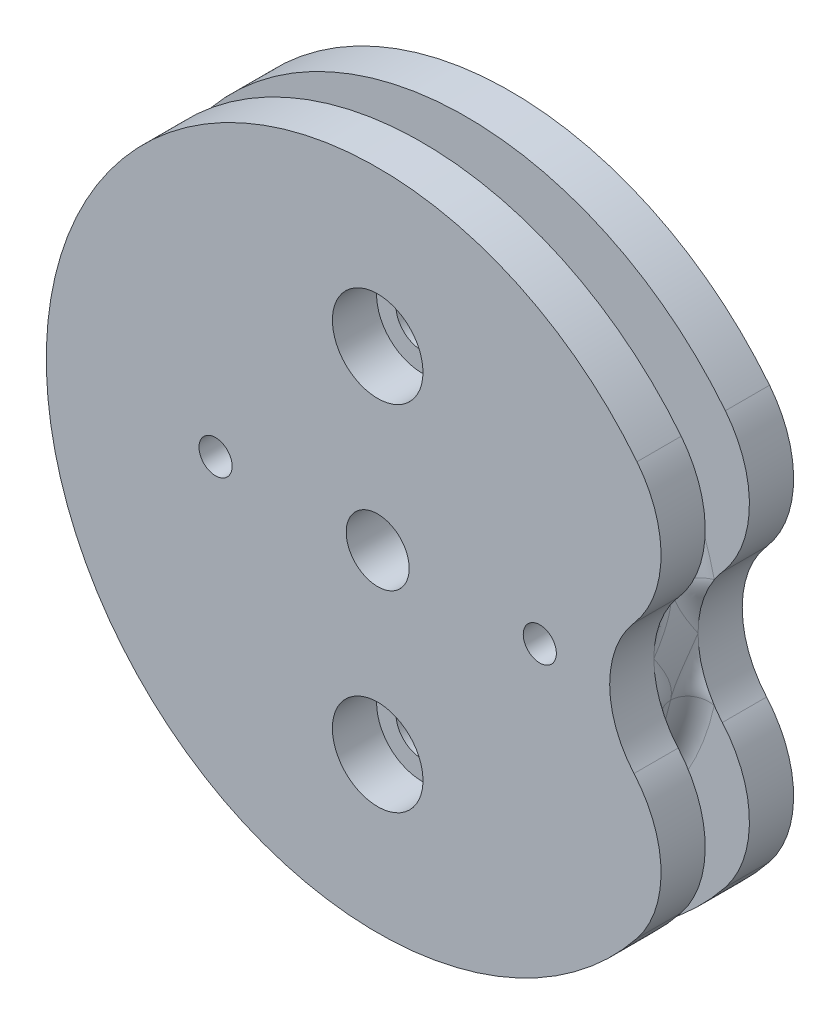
ISO-10303-21;
HEADER;
FILE_DESCRIPTION(('STEP AP214'),'2;1');
FILE_NAME('part.step','',(''),(''),'','','');
FILE_SCHEMA(('AUTOMOTIVE_DESIGN { 1 0 10303 214 1 1 1 1 }'));
ENDSEC;
DATA;
#1=APPLICATION_CONTEXT('core data for automotive mechanical design processes');
#2=APPLICATION_PROTOCOL_DEFINITION('international standard','automotive_design',2000,#1);
#3=PRODUCT_CONTEXT('',#1,'mechanical');
#4=PRODUCT('Part','Part','',(#3));
#5=PRODUCT_RELATED_PRODUCT_CATEGORY('part','',(#4));
#6=PRODUCT_DEFINITION_FORMATION('','',#4);
#7=PRODUCT_DEFINITION_CONTEXT('part definition',#1,'design');
#8=PRODUCT_DEFINITION('design','',#6,#7);
#9=PRODUCT_DEFINITION_SHAPE('','',#8);
#10=(LENGTH_UNIT() NAMED_UNIT(*) SI_UNIT(.MILLI.,.METRE.));
#11=(NAMED_UNIT(*) PLANE_ANGLE_UNIT() SI_UNIT($,.RADIAN.));
#12=(NAMED_UNIT(*) SI_UNIT($,.STERADIAN.) SOLID_ANGLE_UNIT());
#13=UNCERTAINTY_MEASURE_WITH_UNIT(LENGTH_MEASURE(1.E-05),#10,'distance_accuracy_value','');
#14=(GEOMETRIC_REPRESENTATION_CONTEXT(3) GLOBAL_UNCERTAINTY_ASSIGNED_CONTEXT((#13)) GLOBAL_UNIT_ASSIGNED_CONTEXT((#10,
#11,#12)) REPRESENTATION_CONTEXT('',''));
#15=CARTESIAN_POINT('',(0.,0.,0.));
#16=DIRECTION('',(0.,0.,1.));
#17=DIRECTION('',(1.,0.,0.));
#18=AXIS2_PLACEMENT_3D('',#15,#16,#17);
#19=CARTESIAN_POINT('',(0.,0.,3.));
#20=DIRECTION('',(0.,0.,-1.));
#21=DIRECTION('',(-1.,0.,0.));
#22=AXIS2_PLACEMENT_3D('',#19,#20,#21);
#23=CYLINDRICAL_SURFACE('',#22,15.);
#24=CARTESIAN_POINT('',(0.,0.,-1.));
#25=DIRECTION('',(0.,0.,1.));
#26=DIRECTION('',(1.,0.,0.));
#27=AXIS2_PLACEMENT_3D('',#24,#25,#26);
#28=CIRCLE('',#27,15.);
#29=CARTESIAN_POINT('',(11.7375,9.33975876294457,-1.));
#30=VERTEX_POINT('',#29);
#31=CARTESIAN_POINT('',(11.7375,-9.33975876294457,-1.));
#32=VERTEX_POINT('',#31);
#33=EDGE_CURVE('E235',#30,#32,#28,.T.);
#34=ORIENTED_EDGE('',*,*,#33,.F.);
#35=DIRECTION('',(0.,0.,-1.));
#36=VECTOR('',#35,1.);
#37=CARTESIAN_POINT('',(11.7375,9.33975876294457,3.));
#38=LINE('',#37,#36);
#39=CARTESIAN_POINT('',(11.7375,9.33975876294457,-3.));
#40=VERTEX_POINT('',#39);
#41=EDGE_CURVE('E447',#30,#40,#38,.T.);
#42=ORIENTED_EDGE('',*,*,#41,.T.);
#43=CARTESIAN_POINT('',(0.,0.,-3.));
#44=DIRECTION('',(0.,0.,1.));
#45=DIRECTION('',(1.,0.,0.));
#46=AXIS2_PLACEMENT_3D('',#43,#44,#45);
#47=CIRCLE('',#46,15.);
#48=CARTESIAN_POINT('',(11.7375,-9.33975876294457,-3.));
#49=VERTEX_POINT('',#48);
#50=EDGE_CURVE('E212',#40,#49,#47,.T.);
#51=ORIENTED_EDGE('',*,*,#50,.T.);
#52=DIRECTION('',(0.,0.,-1.));
#53=VECTOR('',#52,1.);
#54=CARTESIAN_POINT('',(11.7375,-9.33975876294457,3.));
#55=LINE('',#54,#53);
#56=EDGE_CURVE('E444',#49,#32,#55,.F.);
#57=ORIENTED_EDGE('',*,*,#56,.T.);
#58=EDGE_LOOP('',(#34,#42,#51,#57));
#59=FACE_BOUND('',#58,.T.);
#60=ADVANCED_FACE('F36',(#59),#23,.T.);
#61=CARTESIAN_POINT('',(0.,0.,3.));
#62=DIRECTION('',(0.,0.,-1.));
#63=DIRECTION('',(-1.,0.,0.));
#64=AXIS2_PLACEMENT_3D('',#61,#62,#63);
#65=CYLINDRICAL_SURFACE('',#64,4.175);
#66=CARTESIAN_POINT('',(0.,0.,-3.));
#67=DIRECTION('',(0.,0.,1.));
#68=DIRECTION('',(1.,0.,0.));
#69=AXIS2_PLACEMENT_3D('',#66,#67,#68);
#70=CIRCLE('',#69,4.175);
#71=CARTESIAN_POINT('',(4.175,0.,-3.));
#72=VERTEX_POINT('',#71);
#73=EDGE_CURVE('E216',#72,#72,#70,.T.);
#74=ORIENTED_EDGE('',*,*,#73,.F.);
#75=EDGE_LOOP('',(#74));
#76=FACE_BOUND('',#75,.T.);
#77=CARTESIAN_POINT('',(0.,0.,-0.150000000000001));
#78=DIRECTION('',(0.,0.,1.));
#79=DIRECTION('',(1.,0.,0.));
#80=AXIS2_PLACEMENT_3D('',#77,#78,#79);
#81=CIRCLE('',#80,4.175);
#82=CARTESIAN_POINT('',(4.175,0.,-0.150000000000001));
#83=VERTEX_POINT('',#82);
#84=EDGE_CURVE('E240',#83,#83,#81,.F.);
#85=ORIENTED_EDGE('',*,*,#84,.F.);
#86=EDGE_LOOP('',(#85));
#87=FACE_BOUND('',#86,.T.);
#88=ADVANCED_FACE('F403',(#76,#87),#65,.F.);
#89=CARTESIAN_POINT('',(0.,0.,3.));
#90=DIRECTION('',(0.,0.,1.));
#91=DIRECTION('',(1.,0.,0.));
#92=AXIS2_PLACEMENT_3D('',#89,#90,#91);
#93=PLANE('',#92);
#94=CARTESIAN_POINT('',(-7.3375,0.,3.));
#95=DIRECTION('',(0.,0.,-1.));
#96=DIRECTION('',(1.,0.,0.));
#97=AXIS2_PLACEMENT_3D('',#94,#95,#96);
#98=CIRCLE('',#97,0.749999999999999);
#99=CARTESIAN_POINT('',(-6.5875,0.,3.));
#100=VERTEX_POINT('',#99);
#101=EDGE_CURVE('E183',#100,#100,#98,.T.);
#102=ORIENTED_EDGE('',*,*,#101,.T.);
#103=EDGE_LOOP('',(#102));
#104=FACE_BOUND('',#103,.T.);
#105=CARTESIAN_POINT('',(7.3375,0.,3.));
#106=DIRECTION('',(0.,0.,-1.));
#107=DIRECTION('',(-1.,0.,0.));
#108=AXIS2_PLACEMENT_3D('',#105,#106,#107);
#109=CIRCLE('',#108,0.749999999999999);
#110=CARTESIAN_POINT('',(6.5875,0.,3.));
#111=VERTEX_POINT('',#110);
#112=EDGE_CURVE('E182',#111,#111,#109,.T.);
#113=ORIENTED_EDGE('',*,*,#112,.T.);
#114=EDGE_LOOP('',(#113));
#115=FACE_BOUND('',#114,.T.);
#116=CARTESIAN_POINT('',(15.,0.,3.));
#117=DIRECTION('',(0.,0.,1.));
#118=DIRECTION('',(1.,0.,0.));
#119=AXIS2_PLACEMENT_3D('',#116,#117,#118);
#120=CIRCLE('',#119,4.5);
#121=CARTESIAN_POINT('',(11.6013157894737,2.94939750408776,3.));
#122=VERTEX_POINT('',#121);
#123=CARTESIAN_POINT('',(11.6013157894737,-2.94939750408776,3.));
#124=VERTEX_POINT('',#123);
#125=EDGE_CURVE('E172',#122,#124,#120,.T.);
#126=ORIENTED_EDGE('',*,*,#125,.F.);
#127=CARTESIAN_POINT('',(7.825,6.22650584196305,3.));
#128=DIRECTION('',(0.,0.,1.));
#129=DIRECTION('',(1.,0.,0.));
#130=AXIS2_PLACEMENT_3D('',#127,#128,#129);
#131=CIRCLE('',#130,5.);
#132=CARTESIAN_POINT('',(11.7375,9.33975876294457,3.));
#133=VERTEX_POINT('',#132);
#134=EDGE_CURVE('E430',#122,#133,#131,.T.);
#135=ORIENTED_EDGE('',*,*,#134,.T.);
#136=CARTESIAN_POINT('',(0.,0.,3.));
#137=DIRECTION('',(0.,0.,1.));
#138=DIRECTION('',(1.,0.,0.));
#139=AXIS2_PLACEMENT_3D('',#136,#137,#138);
#140=CIRCLE('',#139,15.);
#141=CARTESIAN_POINT('',(11.7375,-9.33975876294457,3.));
#142=VERTEX_POINT('',#141);
#143=EDGE_CURVE('E255',#133,#142,#140,.T.);
#144=ORIENTED_EDGE('',*,*,#143,.T.);
#145=CARTESIAN_POINT('',(7.825,-6.22650584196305,3.));
#146=DIRECTION('',(0.,0.,1.));
#147=DIRECTION('',(1.,0.,0.));
#148=AXIS2_PLACEMENT_3D('',#145,#146,#147);
#149=CIRCLE('',#148,5.);
#150=EDGE_CURVE('E441',#142,#124,#149,.T.);
#151=ORIENTED_EDGE('',*,*,#150,.T.);
#152=EDGE_LOOP('',(#126,#135,#144,#151));
#153=FACE_BOUND('',#152,.T.);
#154=CARTESIAN_POINT('',(0.,8.,3.));
#155=DIRECTION('',(0.,0.,1.));
#156=DIRECTION('',(1.,0.,0.));
#157=AXIS2_PLACEMENT_3D('',#154,#155,#156);
#158=CIRCLE('',#157,2.05);
#159=CARTESIAN_POINT('',(2.05,8.,3.));
#160=VERTEX_POINT('',#159);
#161=EDGE_CURVE('E251',#160,#160,#158,.T.);
#162=ORIENTED_EDGE('',*,*,#161,.F.);
#163=EDGE_LOOP('',(#162));
#164=FACE_BOUND('',#163,.T.);
#165=CARTESIAN_POINT('',(0.,-8.,3.));
#166=DIRECTION('',(0.,0.,1.));
#167=DIRECTION('',(-1.,0.,0.));
#168=AXIS2_PLACEMENT_3D('',#165,#166,#167);
#169=CIRCLE('',#168,2.05);
#170=CARTESIAN_POINT('',(-2.05,-8.,3.));
#171=VERTEX_POINT('',#170);
#172=EDGE_CURVE('E243',#171,#171,#169,.T.);
#173=ORIENTED_EDGE('',*,*,#172,.F.);
#174=EDGE_LOOP('',(#173));
#175=FACE_BOUND('',#174,.T.);
#176=CARTESIAN_POINT('',(0.,0.,3.));
#177=DIRECTION('',(0.,0.,1.));
#178=DIRECTION('',(1.,0.,0.));
#179=AXIS2_PLACEMENT_3D('',#176,#177,#178);
#180=CIRCLE('',#179,1.425);
#181=CARTESIAN_POINT('',(1.425,0.,3.));
#182=VERTEX_POINT('',#181);
#183=EDGE_CURVE('E237',#182,#182,#180,.T.);
#184=ORIENTED_EDGE('',*,*,#183,.F.);
#185=EDGE_LOOP('',(#184));
#186=FACE_BOUND('',#185,.T.);
#187=ADVANCED_FACE('F192',(#104,#115,#153,#164,#175,#186),#93,.T.);
#188=CARTESIAN_POINT('',(0.,0.,-3.));
#189=DIRECTION('',(0.,0.,1.));
#190=DIRECTION('',(1.,0.,0.));
#191=AXIS2_PLACEMENT_3D('',#188,#189,#190);
#192=PLANE('',#191);
#193=CARTESIAN_POINT('',(-7.3375,0.,-3.));
#194=DIRECTION('',(0.,0.,-1.));
#195=DIRECTION('',(1.,0.,0.));
#196=AXIS2_PLACEMENT_3D('',#193,#194,#195);
#197=CIRCLE('',#196,0.749999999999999);
#198=CARTESIAN_POINT('',(-6.5875,0.,-3.));
#199=VERTEX_POINT('',#198);
#200=EDGE_CURVE('E186',#199,#199,#197,.T.);
#201=ORIENTED_EDGE('',*,*,#200,.F.);
#202=EDGE_LOOP('',(#201));
#203=FACE_BOUND('',#202,.T.);
#204=CARTESIAN_POINT('',(7.3375,0.,-3.));
#205=DIRECTION('',(0.,0.,-1.));
#206=DIRECTION('',(-1.,0.,0.));
#207=AXIS2_PLACEMENT_3D('',#204,#205,#206);
#208=CIRCLE('',#207,0.749999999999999);
#209=CARTESIAN_POINT('',(6.5875,0.,-3.));
#210=VERTEX_POINT('',#209);
#211=EDGE_CURVE('E179',#210,#210,#208,.T.);
#212=ORIENTED_EDGE('',*,*,#211,.F.);
#213=EDGE_LOOP('',(#212));
#214=FACE_BOUND('',#213,.T.);
#215=ORIENTED_EDGE('',*,*,#50,.F.);
#216=CARTESIAN_POINT('',(7.825,6.22650584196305,-3.));
#217=DIRECTION('',(0.,0.,1.));
#218=DIRECTION('',(1.,0.,0.));
#219=AXIS2_PLACEMENT_3D('',#216,#217,#218);
#220=CIRCLE('',#219,5.);
#221=CARTESIAN_POINT('',(11.6013157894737,2.94939750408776,-3.));
#222=VERTEX_POINT('',#221);
#223=EDGE_CURVE('E452',#40,#222,#220,.F.);
#224=ORIENTED_EDGE('',*,*,#223,.T.);
#225=CARTESIAN_POINT('',(15.,0.,-3.));
#226=DIRECTION('',(0.,0.,1.));
#227=DIRECTION('',(1.,0.,0.));
#228=AXIS2_PLACEMENT_3D('',#225,#226,#227);
#229=CIRCLE('',#228,4.5);
#230=CARTESIAN_POINT('',(11.6013157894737,-2.94939750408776,-3.));
#231=VERTEX_POINT('',#230);
#232=EDGE_CURVE('E168',#222,#231,#229,.T.);
#233=ORIENTED_EDGE('',*,*,#232,.T.);
#234=CARTESIAN_POINT('',(7.825,-6.22650584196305,-3.));
#235=DIRECTION('',(0.,0.,1.));
#236=DIRECTION('',(1.,0.,0.));
#237=AXIS2_PLACEMENT_3D('',#234,#235,#236);
#238=CIRCLE('',#237,5.);
#239=EDGE_CURVE('E450',#231,#49,#238,.F.);
#240=ORIENTED_EDGE('',*,*,#239,.T.);
#241=EDGE_LOOP('',(#215,#224,#233,#240));
#242=FACE_BOUND('',#241,.T.);
#243=ORIENTED_EDGE('',*,*,#73,.T.);
#244=EDGE_LOOP('',(#243));
#245=FACE_BOUND('',#244,.T.);
#246=CARTESIAN_POINT('',(0.,-8.,-3.));
#247=DIRECTION('',(0.,0.,-1.));
#248=DIRECTION('',(1.,0.,0.));
#249=AXIS2_PLACEMENT_3D('',#246,#247,#248);
#250=CIRCLE('',#249,1.175);
#251=CARTESIAN_POINT('',(1.175,-8.,-3.));
#252=VERTEX_POINT('',#251);
#253=EDGE_CURVE('E220',#252,#252,#250,.T.);
#254=ORIENTED_EDGE('',*,*,#253,.F.);
#255=EDGE_LOOP('',(#254));
#256=FACE_BOUND('',#255,.T.);
#257=CARTESIAN_POINT('',(0.,8.,-3.));
#258=DIRECTION('',(0.,0.,-1.));
#259=DIRECTION('',(-1.,0.,0.));
#260=AXIS2_PLACEMENT_3D('',#257,#258,#259);
#261=CIRCLE('',#260,1.175);
#262=CARTESIAN_POINT('',(-1.175,8.,-3.));
#263=VERTEX_POINT('',#262);
#264=EDGE_CURVE('E223',#263,#263,#261,.T.);
#265=ORIENTED_EDGE('',*,*,#264,.F.);
#266=EDGE_LOOP('',(#265));
#267=FACE_BOUND('',#266,.T.);
#268=ADVANCED_FACE('F203',(#203,#214,#242,#245,#256,#267),#192,.F.);
#269=ORIENTED_EDGE('',*,*,#143,.F.);
#270=DIRECTION('',(0.,0.,-1.));
#271=VECTOR('',#270,1.);
#272=CARTESIAN_POINT('',(11.7375,9.33975876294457,3.));
#273=LINE('',#272,#271);
#274=CARTESIAN_POINT('',(11.7375,9.33975876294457,1.));
#275=VERTEX_POINT('',#274);
#276=EDGE_CURVE('E424',#133,#275,#273,.T.);
#277=ORIENTED_EDGE('',*,*,#276,.T.);
#278=CARTESIAN_POINT('',(0.,0.,1.));
#279=DIRECTION('',(0.,0.,1.));
#280=DIRECTION('',(1.,0.,0.));
#281=AXIS2_PLACEMENT_3D('',#278,#279,#280);
#282=CIRCLE('',#281,15.);
#283=CARTESIAN_POINT('',(11.7375,-9.33975876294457,1.));
#284=VERTEX_POINT('',#283);
#285=EDGE_CURVE('E234',#275,#284,#282,.T.);
#286=ORIENTED_EDGE('',*,*,#285,.T.);
#287=DIRECTION('',(0.,0.,-1.));
#288=VECTOR('',#287,1.);
#289=CARTESIAN_POINT('',(11.7375,-9.33975876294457,3.));
#290=LINE('',#289,#288);
#291=EDGE_CURVE('E333',#284,#142,#290,.F.);
#292=ORIENTED_EDGE('',*,*,#291,.T.);
#293=EDGE_LOOP('',(#269,#277,#286,#292));
#294=FACE_BOUND('',#293,.T.);
#295=ADVANCED_FACE('F206',(#294),#23,.T.);
#296=CARTESIAN_POINT('',(0.,8.,3.));
#297=DIRECTION('',(0.,0.,-1.));
#298=DIRECTION('',(-1.,0.,0.));
#299=AXIS2_PLACEMENT_3D('',#296,#297,#298);
#300=CYLINDRICAL_SURFACE('',#299,2.05);
#301=CARTESIAN_POINT('',(0.,8.,1.));
#302=DIRECTION('',(0.,0.,1.));
#303=DIRECTION('',(1.,0.,0.));
#304=AXIS2_PLACEMENT_3D('',#301,#302,#303);
#305=CIRCLE('',#304,2.05);
#306=CARTESIAN_POINT('',(2.05,8.,1.));
#307=VERTEX_POINT('',#306);
#308=EDGE_CURVE('E262',#307,#307,#305,.T.);
#309=ORIENTED_EDGE('',*,*,#308,.F.);
#310=EDGE_LOOP('',(#309));
#311=FACE_BOUND('',#310,.T.);
#312=ORIENTED_EDGE('',*,*,#161,.T.);
#313=EDGE_LOOP('',(#312));
#314=FACE_BOUND('',#313,.T.);
#315=ADVANCED_FACE('F412',(#311,#314),#300,.F.);
#316=CARTESIAN_POINT('',(0.,-8.,3.));
#317=DIRECTION('',(0.,0.,-1.));
#318=DIRECTION('',(-1.,0.,0.));
#319=AXIS2_PLACEMENT_3D('',#316,#317,#318);
#320=CYLINDRICAL_SURFACE('',#319,2.05);
#321=CARTESIAN_POINT('',(0.,-8.,1.));
#322=DIRECTION('',(0.,0.,1.));
#323=DIRECTION('',(1.,0.,0.));
#324=AXIS2_PLACEMENT_3D('',#321,#322,#323);
#325=CIRCLE('',#324,2.05);
#326=CARTESIAN_POINT('',(2.05,-8.,1.));
#327=VERTEX_POINT('',#326);
#328=EDGE_CURVE('E258',#327,#327,#325,.T.);
#329=ORIENTED_EDGE('',*,*,#328,.F.);
#330=EDGE_LOOP('',(#329));
#331=FACE_BOUND('',#330,.T.);
#332=ORIENTED_EDGE('',*,*,#172,.T.);
#333=EDGE_LOOP('',(#332));
#334=FACE_BOUND('',#333,.T.);
#335=ADVANCED_FACE('F417',(#331,#334),#320,.F.);
#336=CARTESIAN_POINT('',(0.,0.,-14.8086832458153));
#337=DIRECTION('',(0.,0.,1.));
#338=DIRECTION('',(1.,0.,0.));
#339=AXIS2_PLACEMENT_3D('',#336,#337,#338);
#340=CYLINDRICAL_SURFACE('',#339,1.425);
#341=CARTESIAN_POINT('',(0.,0.,-0.150000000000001));
#342=DIRECTION('',(0.,0.,1.));
#343=DIRECTION('',(1.,0.,0.));
#344=AXIS2_PLACEMENT_3D('',#341,#342,#343);
#345=CIRCLE('',#344,1.425);
#346=CARTESIAN_POINT('',(1.425,0.,-0.150000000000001));
#347=VERTEX_POINT('',#346);
#348=EDGE_CURVE('E244',#347,#347,#345,.F.);
#349=ORIENTED_EDGE('',*,*,#348,.T.);
#350=EDGE_LOOP('',(#349));
#351=FACE_BOUND('',#350,.T.);
#352=ORIENTED_EDGE('',*,*,#183,.T.);
#353=EDGE_LOOP('',(#352));
#354=FACE_BOUND('',#353,.T.);
#355=ADVANCED_FACE('F489',(#351,#354),#340,.F.);
#356=CARTESIAN_POINT('',(0.,0.,-0.15));
#357=DIRECTION('',(0.,0.,1.));
#358=DIRECTION('',(1.,0.,0.));
#359=AXIS2_PLACEMENT_3D('',#356,#357,#358);
#360=PLANE('',#359);
#361=ORIENTED_EDGE('',*,*,#84,.T.);
#362=EDGE_LOOP('',(#361));
#363=FACE_BOUND('',#362,.T.);
#364=ORIENTED_EDGE('',*,*,#348,.F.);
#365=EDGE_LOOP('',(#364));
#366=FACE_BOUND('',#365,.T.);
#367=ADVANCED_FACE('F491',(#363,#366),#360,.F.);
#368=CARTESIAN_POINT('',(0.,0.,-1.));
#369=DIRECTION('',(0.,0.,1.));
#370=DIRECTION('',(1.,0.,0.));
#371=AXIS2_PLACEMENT_3D('',#368,#369,#370);
#372=PLANE('',#371);
#373=CARTESIAN_POINT('',(15.,0.,-1.));
#374=DIRECTION('',(0.,0.,1.));
#375=DIRECTION('',(1.,0.,0.));
#376=AXIS2_PLACEMENT_3D('',#373,#374,#375);
#377=CIRCLE('',#376,4.5);
#378=CARTESIAN_POINT('',(11.6013157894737,2.94939750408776,-1.));
#379=VERTEX_POINT('',#378);
#380=CARTESIAN_POINT('',(11.2333333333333,2.46215804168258,-1.));
#381=VERTEX_POINT('',#380);
#382=EDGE_CURVE('E166',#379,#381,#377,.T.);
#383=ORIENTED_EDGE('',*,*,#382,.F.);
#384=CARTESIAN_POINT('',(7.825,6.22650584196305,-1.));
#385=DIRECTION('',(0.,0.,1.));
#386=DIRECTION('',(1.,0.,0.));
#387=AXIS2_PLACEMENT_3D('',#384,#385,#386);
#388=CIRCLE('',#387,5.);
#389=EDGE_CURVE('E12',#379,#30,#388,.T.);
#390=ORIENTED_EDGE('',*,*,#389,.T.);
#391=ORIENTED_EDGE('',*,*,#33,.T.);
#392=CARTESIAN_POINT('',(7.825,-6.22650584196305,-1.));
#393=DIRECTION('',(0.,0.,1.));
#394=DIRECTION('',(1.,0.,0.));
#395=AXIS2_PLACEMENT_3D('',#392,#393,#394);
#396=CIRCLE('',#395,5.);
#397=CARTESIAN_POINT('',(11.6013157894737,-2.94939750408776,-1.));
#398=VERTEX_POINT('',#397);
#399=EDGE_CURVE('E44',#32,#398,#396,.T.);
#400=ORIENTED_EDGE('',*,*,#399,.T.);
#401=CARTESIAN_POINT('',(11.2333333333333,-2.46215804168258,-1.));
#402=VERTEX_POINT('',#401);
#403=EDGE_CURVE('E151',#402,#398,#377,.T.);
#404=ORIENTED_EDGE('',*,*,#403,.F.);
#405=CARTESIAN_POINT('',(0.,0.,-1.));
#406=DIRECTION('',(0.,0.,1.));
#407=DIRECTION('',(1.,0.,0.));
#408=AXIS2_PLACEMENT_3D('',#405,#406,#407);
#409=CIRCLE('',#408,11.5);
#410=EDGE_CURVE('E157',#402,#381,#409,.F.);
#411=ORIENTED_EDGE('',*,*,#410,.T.);
#412=EDGE_LOOP('',(#383,#390,#391,#400,#404,#411));
#413=FACE_BOUND('',#412,.T.);
#414=ADVANCED_FACE('F289',(#413),#372,.T.);
#415=CARTESIAN_POINT('',(0.,0.,1.));
#416=DIRECTION('',(0.,0.,1.));
#417=DIRECTION('',(1.,0.,0.));
#418=AXIS2_PLACEMENT_3D('',#415,#416,#417);
#419=PLANE('',#418);
#420=ORIENTED_EDGE('',*,*,#285,.F.);
#421=CARTESIAN_POINT('',(7.825,6.22650584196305,1.));
#422=DIRECTION('',(0.,0.,1.));
#423=DIRECTION('',(1.,0.,0.));
#424=AXIS2_PLACEMENT_3D('',#421,#422,#423);
#425=CIRCLE('',#424,5.);
#426=CARTESIAN_POINT('',(11.6013157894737,2.94939750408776,1.));
#427=VERTEX_POINT('',#426);
#428=EDGE_CURVE('E431',#275,#427,#425,.F.);
#429=ORIENTED_EDGE('',*,*,#428,.T.);
#430=CARTESIAN_POINT('',(15.,0.,1.));
#431=DIRECTION('',(0.,0.,1.));
#432=DIRECTION('',(1.,0.,0.));
#433=AXIS2_PLACEMENT_3D('',#430,#431,#432);
#434=CIRCLE('',#433,4.5);
#435=CARTESIAN_POINT('',(11.2333333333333,2.46215804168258,1.));
#436=VERTEX_POINT('',#435);
#437=EDGE_CURVE('E153',#427,#436,#434,.T.);
#438=ORIENTED_EDGE('',*,*,#437,.T.);
#439=CARTESIAN_POINT('',(0.,0.,1.));
#440=DIRECTION('',(0.,0.,1.));
#441=DIRECTION('',(1.,0.,0.));
#442=AXIS2_PLACEMENT_3D('',#439,#440,#441);
#443=CIRCLE('',#442,11.5);
#444=CARTESIAN_POINT('',(11.2333333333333,-2.46215804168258,1.));
#445=VERTEX_POINT('',#444);
#446=EDGE_CURVE('E265',#436,#445,#443,.T.);
#447=ORIENTED_EDGE('',*,*,#446,.T.);
#448=CARTESIAN_POINT('',(11.6013157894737,-2.94939750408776,1.));
#449=VERTEX_POINT('',#448);
#450=EDGE_CURVE('E147',#445,#449,#434,.T.);
#451=ORIENTED_EDGE('',*,*,#450,.T.);
#452=CARTESIAN_POINT('',(7.825,-6.22650584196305,1.));
#453=DIRECTION('',(0.,0.,1.));
#454=DIRECTION('',(1.,0.,0.));
#455=AXIS2_PLACEMENT_3D('',#452,#453,#454);
#456=CIRCLE('',#455,5.);
#457=EDGE_CURVE('E432',#449,#284,#456,.F.);
#458=ORIENTED_EDGE('',*,*,#457,.T.);
#459=EDGE_LOOP('',(#420,#429,#438,#447,#451,#458));
#460=FACE_BOUND('',#459,.T.);
#461=ADVANCED_FACE('F286',(#460),#419,.F.);
#462=CARTESIAN_POINT('',(0.,0.,-1.));
#463=DIRECTION('',(0.,0.,1.));
#464=DIRECTION('',(1.,0.,0.));
#465=AXIS2_PLACEMENT_3D('',#462,#463,#464);
#466=CYLINDRICAL_SURFACE('',#465,10.5);
#467=CARTESIAN_POINT('',(10.1460099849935,2.70342031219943,0.0778486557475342));
#468=CARTESIAN_POINT('',(10.249171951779,2.31625064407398,1.28646877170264));
#469=CARTESIAN_POINT('',(11.4200375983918,2.72651227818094,1.));
#470=CARTESIAN_POINT('',(10.1657562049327,2.62943704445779,0.0500836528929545));
#471=CARTESIAN_POINT('',(10.2421797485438,2.33130244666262,1.24017321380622));
#472=CARTESIAN_POINT('',(11.391433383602,2.68895078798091,1.));
#473=CARTESIAN_POINT('',(10.1851422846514,2.55330728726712,0.0304704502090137));
#474=CARTESIAN_POINT('',(10.2402002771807,2.33166318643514,1.18930577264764));
#475=CARTESIAN_POINT('',(11.3609793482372,2.6477413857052,1.));
#476=CARTESIAN_POINT('',(10.2224050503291,2.39967331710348,0.00542892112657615));
#477=CARTESIAN_POINT('',(10.2438823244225,2.30620680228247,1.09041084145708));
#478=CARTESIAN_POINT('',(11.297852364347,2.55872079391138,1.));
#479=CARTESIAN_POINT('',(10.2402968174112,2.32219583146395,-0.000163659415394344));
#480=CARTESIAN_POINT('',(10.2491225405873,2.28185264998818,1.04237978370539));
#481=CARTESIAN_POINT('',(11.2652097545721,2.51099302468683,1.));
#482=CARTESIAN_POINT('',(10.2827554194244,2.12819095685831,0.000255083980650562));
#483=CARTESIAN_POINT('',(10.2678530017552,2.19630751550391,0.935080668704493));
#484=CARTESIAN_POINT('',(11.1817967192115,2.38320783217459,1.));
#485=CARTESIAN_POINT('',(10.3061945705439,2.01148153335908,0.013454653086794));
#486=CARTESIAN_POINT('',(10.2839251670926,2.12375355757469,0.879370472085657));
#487=CARTESIAN_POINT('',(11.1301130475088,2.29890693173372,1.));
#488=CARTESIAN_POINT('',(10.3487120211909,1.7799344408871,0.0590799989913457));
#489=CARTESIAN_POINT('',(10.3188219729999,1.95130908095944,0.794998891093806));
#490=CARTESIAN_POINT('',(11.0267980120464,2.1153831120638,1.));
#491=CARTESIAN_POINT('',(10.3677600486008,1.66511455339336,0.0916340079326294));
#492=CARTESIAN_POINT('',(10.3375960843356,1.85233349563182,0.76482728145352));
#493=CARTESIAN_POINT('',(10.975169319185,2.01606399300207,1.));
#494=CARTESIAN_POINT('',(10.4051025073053,1.41526890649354,0.17889869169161));
#495=CARTESIAN_POINT('',(10.3770612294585,1.61964933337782,0.725187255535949));
#496=CARTESIAN_POINT('',(10.8652907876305,1.78163166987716,1.));
#497=CARTESIAN_POINT('',(10.4223997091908,1.28106013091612,0.236825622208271));
#498=CARTESIAN_POINT('',(10.3978692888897,1.48152898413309,0.719195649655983));
#499=CARTESIAN_POINT('',(10.8079255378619,1.64338097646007,1.));
#500=CARTESIAN_POINT('',(10.4514440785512,1.01734055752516,0.365914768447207));
#501=CARTESIAN_POINT('',(10.4338828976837,1.19819339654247,0.732823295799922));
#502=CARTESIAN_POINT('',(10.7043935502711,1.34982345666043,1.));
#503=CARTESIAN_POINT('',(10.4631799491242,0.887839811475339,0.437103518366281));
#504=CARTESIAN_POINT('',(10.449523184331,1.05159939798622,0.751500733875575));
#505=CARTESIAN_POINT('',(10.6582496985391,1.19448269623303,1.));
#506=CARTESIAN_POINT('',(10.4817288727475,0.632289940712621,0.587485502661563));
#507=CARTESIAN_POINT('',(10.4743843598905,0.757198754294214,0.804471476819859));
#508=CARTESIAN_POINT('',(10.5820059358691,0.871159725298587,1.));
#509=CARTESIAN_POINT('',(10.4885357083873,0.506245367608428,0.666688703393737));
#510=CARTESIAN_POINT('',(10.4839406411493,0.607502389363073,0.838689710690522));
#511=CARTESIAN_POINT('',(10.5519263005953,0.703161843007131,1.));
#512=CARTESIAN_POINT('',(10.4976205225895,0.256149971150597,0.828787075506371));
#513=CARTESIAN_POINT('',(10.4965863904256,0.309482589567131,0.91416358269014));
#514=CARTESIAN_POINT('',(10.5111592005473,0.360585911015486,1.));
#515=CARTESIAN_POINT('',(10.4999017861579,0.132097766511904,0.911679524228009));
#516=CARTESIAN_POINT('',(10.499860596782,0.159078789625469,0.955834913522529));
#517=CARTESIAN_POINT('',(10.500457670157,0.186012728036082,1.));
#518=CARTESIAN_POINT('',(10.4999989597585,0.00538249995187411,0.996401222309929));
#519=CARTESIAN_POINT('',(10.4999985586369,0.00648097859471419,0.998200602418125));
#520=CARTESIAN_POINT('',(10.500004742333,0.00757944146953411,1.));
#521=CARTESIAN_POINT('',(10.4999999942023,0.00269124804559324,0.998200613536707));
#522=CARTESIAN_POINT('',(10.500000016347,0.00324048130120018,0.999100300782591));
#523=CARTESIAN_POINT('',(10.4999999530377,0.00378972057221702,1.));
#524=CARTESIAN_POINT('',(10.5,0.,1.));
#525=CARTESIAN_POINT('',(10.5,0.,1.));
#526=CARTESIAN_POINT('',(10.5,1.62525146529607E-12,1.));
#527=(BOUNDED_SURFACE() B_SPLINE_SURFACE(3,2,((#467,#468,#469),(#470,#471,#472),(#473,#474,
#475),(#476,#477,#478),(#479,#480,#481),(#482,#483,#484),(#485,#486,#487),(#488,#489,#490),
(#491,#492,#493),(#494,#495,#496),(#497,#498,#499),(#500,#501,#502),(#503,#504,#505),(#506,#507,
#508),(#509,#510,#511),(#512,#513,#514),(#515,#516,#517),(#518,#519,#520),(#521,#522,#523),
(#524,#525,#526)),.UNSPECIFIED.,.F.,.F.,.F.) B_SPLINE_SURFACE_WITH_KNOTS((4,2,2,2,2,2,2,2,2,4),
(3,3),(0.,0.263885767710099,0.524665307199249,0.915654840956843,1.30926419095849,
1.78548455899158,2.26266818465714,2.74045267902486,3.21789023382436,3.22825041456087),(0.,1.),
.UNSPECIFIED.) GEOMETRIC_REPRESENTATION_ITEM() RATIONAL_B_SPLINE_SURFACE(((1.,0.617648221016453,
1.),(1.,0.631867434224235,1.),(1.,0.646760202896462,1.),(1.,0.67703879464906,1.),(1.,
0.692416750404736,1.),(1.,0.730857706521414,1.),(1.,0.753924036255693,1.),(1.,0.798564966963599,
1.),(1.,0.82012853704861,1.),(1.,0.86472874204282,1.),(1.,0.887124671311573,1.),(1.,
0.92652239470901,1.),(1.,0.943513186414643,1.),(1.,0.971151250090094,1.),(1.,0.981790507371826,
1.),(1.,0.996132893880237,1.),(1.,0.999841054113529,1.),(1.,0.999998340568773,1.),(1.,
1.00000000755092,1.),(1.,1.,1.))) REPRESENTATION_ITEM('') SURFACE());
#528=CARTESIAN_POINT('',(10.1460099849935,2.70342031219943,0.0778486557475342));
#529=CARTESIAN_POINT('',(10.1657562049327,2.62943704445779,0.0500836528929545));
#530=CARTESIAN_POINT('',(10.1851422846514,2.55330728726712,0.0304704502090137));
#531=CARTESIAN_POINT('',(10.2224050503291,2.39967331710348,0.00542892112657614));
#532=CARTESIAN_POINT('',(10.2402968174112,2.32219583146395,-0.000163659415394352));
#533=CARTESIAN_POINT('',(10.2827554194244,2.12819095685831,0.000255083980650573));
#534=CARTESIAN_POINT('',(10.3061945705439,2.01148153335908,0.013454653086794));
#535=CARTESIAN_POINT('',(10.3487120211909,1.7799344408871,0.0590799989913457));
#536=CARTESIAN_POINT('',(10.3677600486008,1.66511455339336,0.0916340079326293));
#537=CARTESIAN_POINT('',(10.4051025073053,1.41526890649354,0.17889869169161));
#538=CARTESIAN_POINT('',(10.4223997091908,1.28106013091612,0.236825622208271));
#539=CARTESIAN_POINT('',(10.4514440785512,1.01734055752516,0.365914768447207));
#540=CARTESIAN_POINT('',(10.4631799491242,0.887839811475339,0.437103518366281));
#541=CARTESIAN_POINT('',(10.4817288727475,0.632289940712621,0.587485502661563));
#542=CARTESIAN_POINT('',(10.4885357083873,0.50624536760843,0.666688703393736));
#543=CARTESIAN_POINT('',(10.4976205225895,0.256149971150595,0.828787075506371));
#544=CARTESIAN_POINT('',(10.4999017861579,0.1320977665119,0.911679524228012));
#545=CARTESIAN_POINT('',(10.4999989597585,0.00538249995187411,0.996401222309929));
#546=CARTESIAN_POINT('',(10.4999999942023,0.00269124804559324,0.998200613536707));
#547=CARTESIAN_POINT('',(10.5,0.,1.));
#548=B_SPLINE_CURVE_WITH_KNOTS('',3,(#528,#529,#530,#531,#532,#533,#534,#535,#536,#537,#538,
#539,#540,#541,#542,#543,#544,#545,#546,#547),.UNSPECIFIED.,.F.,.F.,(4,2,2,2,2,2,2,2,2,4),(0.,
0.263885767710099,0.524665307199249,0.915654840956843,1.30926419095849,1.78548455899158,
2.26266818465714,2.74045267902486,3.21789023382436,3.22825041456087),.UNSPECIFIED.);
#549=CARTESIAN_POINT('',(10.2565217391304,2.24805734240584,0.));
#550=VERTEX_POINT('',#549);
#551=CARTESIAN_POINT('',(10.5,0.,1.));
#552=VERTEX_POINT('',#551);
#553=EDGE_CURVE('E123',#550,#552,#548,.T.);
#554=ORIENTED_EDGE('',*,*,#553,.T.);
#555=CARTESIAN_POINT('',(11.4200375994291,-2.72651227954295,1.));
#556=CARTESIAN_POINT('',(10.249171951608,-2.31625064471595,1.28646877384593));
#557=CARTESIAN_POINT('',(10.1460099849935,-2.70342031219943,0.0778486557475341));
#558=CARTESIAN_POINT('',(11.3914333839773,-2.68895078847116,1.));
#559=CARTESIAN_POINT('',(10.2421797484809,-2.331302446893,1.24017321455));
#560=CARTESIAN_POINT('',(10.1657562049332,-2.62943704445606,0.050083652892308));
#561=CARTESIAN_POINT('',(11.360979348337,-2.6477413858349,1.));
#562=CARTESIAN_POINT('',(10.2402002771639,-2.33166318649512,1.18930577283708));
#563=CARTESIAN_POINT('',(10.1851422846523,-2.55330728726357,0.0304704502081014));
#564=CARTESIAN_POINT('',(11.2978523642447,-2.55872079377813,1.));
#565=CARTESIAN_POINT('',(10.2438823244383,-2.30620680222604,1.09041084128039));
#566=CARTESIAN_POINT('',(10.22240505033,-2.39967331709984,0.0054289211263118));
#567=CARTESIAN_POINT('',(11.2652097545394,-2.51099302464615,1.));
#568=CARTESIAN_POINT('',(10.2491225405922,-2.28185264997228,1.04237978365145));
#569=CARTESIAN_POINT('',(10.2402968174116,-2.32219583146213,-0.000163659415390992));
#570=CARTESIAN_POINT('',(11.1817967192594,-2.38320783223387,1.));
#571=CARTESIAN_POINT('',(10.2678530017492,-2.1963075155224,0.935080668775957));
#572=CARTESIAN_POINT('',(10.2827554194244,-2.12819095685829,0.000255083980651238));
#573=CARTESIAN_POINT('',(11.1301130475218,-2.29890693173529,1.));
#574=CARTESIAN_POINT('',(10.2839251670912,-2.12375355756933,0.879370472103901));
#575=CARTESIAN_POINT('',(10.3061945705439,-2.01148153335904,0.0134546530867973));
#576=CARTESIAN_POINT('',(11.026798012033,-2.11538311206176,1.));
#577=CARTESIAN_POINT('',(10.3188219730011,-1.95130908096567,0.79499889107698));
#578=CARTESIAN_POINT('',(10.3487120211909,-1.77993444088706,0.0590799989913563));
#579=CARTESIAN_POINT('',(10.9751693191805,-2.01606399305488,1.));
#580=CARTESIAN_POINT('',(10.337596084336,-1.85233349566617,0.764827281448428));
#581=CARTESIAN_POINT('',(10.3677600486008,-1.66511455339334,0.0916340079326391));
#582=CARTESIAN_POINT('',(10.8652907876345,-1.78163166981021,1.));
#583=CARTESIAN_POINT('',(10.3770612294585,-1.61964933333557,0.725187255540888));
#584=CARTESIAN_POINT('',(10.4051025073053,-1.41526890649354,0.178898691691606));
#585=CARTESIAN_POINT('',(10.807925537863,-1.64338097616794,1.));
#586=CARTESIAN_POINT('',(10.3978692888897,-1.48152898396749,0.719195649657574));
#587=CARTESIAN_POINT('',(10.4223997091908,-1.28106013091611,0.236825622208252));
#588=CARTESIAN_POINT('',(10.7043935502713,-1.34982345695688,1.));
#589=CARTESIAN_POINT('',(10.4338828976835,-1.19819339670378,0.73282329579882));
#590=CARTESIAN_POINT('',(10.4514440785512,-1.01734055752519,0.365914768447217));
#591=CARTESIAN_POINT('',(10.6582496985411,-1.19448269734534,1.));
#592=CARTESIAN_POINT('',(10.4495231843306,-1.05159939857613,0.751500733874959));
#593=CARTESIAN_POINT('',(10.4631799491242,-0.887839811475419,0.437103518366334));
#594=CARTESIAN_POINT('',(10.5820059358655,-0.871159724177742,1.));
#595=CARTESIAN_POINT('',(10.4743843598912,-0.75719875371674,0.804471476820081));
#596=CARTESIAN_POINT('',(10.4817288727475,-0.632289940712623,0.587485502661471));
#597=CARTESIAN_POINT('',(10.5519263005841,-0.703161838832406,1.));
#598=CARTESIAN_POINT('',(10.4839406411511,-0.60750238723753,0.838689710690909));
#599=CARTESIAN_POINT('',(10.4885357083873,-0.506245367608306,0.66668870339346));
#600=CARTESIAN_POINT('',(10.5111592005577,-0.360585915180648,1.));
#601=CARTESIAN_POINT('',(10.496586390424,-0.30948259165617,0.914163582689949));
#602=CARTESIAN_POINT('',(10.4976205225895,-0.256149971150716,0.82878707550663));
#603=CARTESIAN_POINT('',(10.5004576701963,-0.186012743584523,1.));
#604=CARTESIAN_POINT('',(10.499860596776,-0.159078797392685,0.955834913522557));
#605=CARTESIAN_POINT('',(10.4999017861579,-0.13209776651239,0.91167952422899));
#606=CARTESIAN_POINT('',(10.5000047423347,-0.0075794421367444,1.));
#607=CARTESIAN_POINT('',(10.4999985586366,-0.00648097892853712,0.998200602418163));
#608=CARTESIAN_POINT('',(10.4999989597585,-0.00538249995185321,0.99640122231));
#609=CARTESIAN_POINT('',(10.4999999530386,-0.00378972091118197,1.));
#610=CARTESIAN_POINT('',(10.5000000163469,-0.00324048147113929,0.999100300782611));
#611=CARTESIAN_POINT('',(10.4999999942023,-0.00269124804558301,0.998200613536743));
#612=CARTESIAN_POINT('',(10.5,2.12381644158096E-13,1.));
#613=CARTESIAN_POINT('',(10.5,2.12381644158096E-13,1.));
#614=CARTESIAN_POINT('',(10.5,0.,1.));
#615=(BOUNDED_SURFACE() B_SPLINE_SURFACE(3,2,((#555,#556,#557),(#558,#559,#560),(#561,#562,
#563),(#564,#565,#566),(#567,#568,#569),(#570,#571,#572),(#573,#574,#575),(#576,#577,#578),
(#579,#580,#581),(#582,#583,#584),(#585,#586,#587),(#588,#589,#590),(#591,#592,#593),(#594,#595,
#596),(#597,#598,#599),(#600,#601,#602),(#603,#604,#605),(#606,#607,#608),(#609,#610,#611),
(#612,#613,#614)),.UNSPECIFIED.,.F.,.F.,.F.) B_SPLINE_SURFACE_WITH_KNOTS((4,2,2,2,2,2,2,2,2,4),
(3,3),(0.,0.263885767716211,0.524665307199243,0.915654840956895,1.30926419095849,
1.78548455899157,2.26266818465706,2.74045267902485,3.21789023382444,3.22825041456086),(0.,1.),
.UNSPECIFIED.) GEOMETRIC_REPRESENTATION_ITEM() RATIONAL_B_SPLINE_SURFACE(((1.,0.617648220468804,
1.),(1.,0.631867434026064,1.),(1.,0.646760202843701,1.),(1.,0.677038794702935,1.),(1.,
0.692416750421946,1.),(1.,0.730857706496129,1.),(1.,0.753924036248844,1.),(1.,0.798564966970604,
1.),(1.,0.820128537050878,1.),(1.,0.864728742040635,1.),(1.,0.887124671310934,1.),(1.,
0.926522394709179,1.),(1.,0.94351318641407,1.),(1.,0.971151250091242,1.),(1.,0.98179050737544,
1.),(1.,0.99613289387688,1.),(1.,0.999841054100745,1.),(1.,0.999998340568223,1.),(1.,
1.00000000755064,1.),(1.,1.,1.))) REPRESENTATION_ITEM('') SURFACE());
#616=CARTESIAN_POINT('',(10.1460099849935,-2.70342031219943,0.0778486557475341));
#617=CARTESIAN_POINT('',(10.1657562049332,-2.62943704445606,0.050083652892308));
#618=CARTESIAN_POINT('',(10.1851422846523,-2.55330728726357,0.0304704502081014));
#619=CARTESIAN_POINT('',(10.22240505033,-2.39967331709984,0.00542892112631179));
#620=CARTESIAN_POINT('',(10.2402968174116,-2.32219583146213,-0.000163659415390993));
#621=CARTESIAN_POINT('',(10.2827554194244,-2.12819095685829,0.000255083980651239));
#622=CARTESIAN_POINT('',(10.3061945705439,-2.01148153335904,0.0134546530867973));
#623=CARTESIAN_POINT('',(10.3487120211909,-1.77993444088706,0.0590799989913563));
#624=CARTESIAN_POINT('',(10.3677600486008,-1.66511455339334,0.0916340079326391));
#625=CARTESIAN_POINT('',(10.4051025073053,-1.41526890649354,0.178898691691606));
#626=CARTESIAN_POINT('',(10.4223997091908,-1.28106013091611,0.236825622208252));
#627=CARTESIAN_POINT('',(10.4514440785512,-1.01734055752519,0.365914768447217));
#628=CARTESIAN_POINT('',(10.4631799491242,-0.887839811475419,0.437103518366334));
#629=CARTESIAN_POINT('',(10.4817288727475,-0.632289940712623,0.587485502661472));
#630=CARTESIAN_POINT('',(10.4885357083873,-0.506245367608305,0.666688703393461));
#631=CARTESIAN_POINT('',(10.4976205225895,-0.256149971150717,0.82878707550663));
#632=CARTESIAN_POINT('',(10.4999017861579,-0.132097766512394,0.911679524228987));
#633=CARTESIAN_POINT('',(10.4999989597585,-0.00538249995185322,0.99640122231));
#634=CARTESIAN_POINT('',(10.4999999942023,-0.00269124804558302,0.998200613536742));
#635=CARTESIAN_POINT('',(10.5,0.,1.));
#636=B_SPLINE_CURVE_WITH_KNOTS('',3,(#616,#617,#618,#619,#620,#621,#622,#623,#624,#625,#626,
#627,#628,#629,#630,#631,#632,#633,#634,#635),.UNSPECIFIED.,.F.,.F.,(4,2,2,2,2,2,2,2,2,4),(0.,
0.263885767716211,0.524665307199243,0.915654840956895,1.30926419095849,1.78548455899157,
2.26266818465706,2.74045267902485,3.21789023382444,3.22825041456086),.UNSPECIFIED.);
#637=CARTESIAN_POINT('',(10.2565217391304,-2.24805734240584,0.));
#638=VERTEX_POINT('',#637);
#639=EDGE_CURVE('E128',#552,#638,#636,.F.);
#640=ORIENTED_EDGE('',*,*,#639,.T.);
#641=CARTESIAN_POINT('',(10.1460099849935,-2.70342031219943,-0.0778486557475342));
#642=CARTESIAN_POINT('',(10.2491719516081,-2.31625064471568,-1.28646877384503));
#643=CARTESIAN_POINT('',(11.4200375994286,-2.72651227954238,-1.));
#644=CARTESIAN_POINT('',(10.1657562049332,-2.62943704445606,-0.0500836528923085));
#645=CARTESIAN_POINT('',(10.2421797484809,-2.33130244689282,-1.24017321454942));
#646=CARTESIAN_POINT('',(11.391433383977,-2.68895078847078,-1.));
#647=CARTESIAN_POINT('',(10.1851422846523,-2.55330728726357,-0.0304704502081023));
#648=CARTESIAN_POINT('',(10.240200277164,-2.3316631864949,-1.18930577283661));
#649=CARTESIAN_POINT('',(11.3609793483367,-2.64774138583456,-1.));
#650=CARTESIAN_POINT('',(10.22240505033,-2.39967331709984,-0.00542892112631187));
#651=CARTESIAN_POINT('',(10.2438823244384,-2.30620680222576,-1.09041084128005));
#652=CARTESIAN_POINT('',(11.2978523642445,-2.55872079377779,-1.));
#653=CARTESIAN_POINT('',(10.2402968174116,-2.32219583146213,0.000163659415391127));
#654=CARTESIAN_POINT('',(10.2491225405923,-2.28185264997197,-1.04237978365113));
#655=CARTESIAN_POINT('',(11.2652097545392,-2.51099302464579,-1.));
#656=CARTESIAN_POINT('',(10.2827554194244,-2.12819095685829,-0.000255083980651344));
#657=CARTESIAN_POINT('',(10.2678530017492,-2.19630751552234,-0.935080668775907));
#658=CARTESIAN_POINT('',(11.1817967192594,-2.38320783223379,-1.));
#659=CARTESIAN_POINT('',(10.3061945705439,-2.01148153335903,-0.0134546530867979));
#660=CARTESIAN_POINT('',(10.2839251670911,-2.12375355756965,-0.879370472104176));
#661=CARTESIAN_POINT('',(11.130113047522,-2.29890693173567,-1.));
#662=CARTESIAN_POINT('',(10.3487120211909,-1.77993444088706,-0.0590799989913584));
#663=CARTESIAN_POINT('',(10.3188219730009,-1.95130908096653,-0.79499889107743));
#664=CARTESIAN_POINT('',(11.0267980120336,-2.11538311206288,-1.));
#665=CARTESIAN_POINT('',(10.3677600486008,-1.66511455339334,-0.0916340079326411));
#666=CARTESIAN_POINT('',(10.3375960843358,-1.85233349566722,-0.764827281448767));
#667=CARTESIAN_POINT('',(10.9751693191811,-2.01606399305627,-1.));
#668=CARTESIAN_POINT('',(10.4051025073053,-1.41526890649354,-0.178898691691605));
#669=CARTESIAN_POINT('',(10.3770612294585,-1.61964933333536,-0.725187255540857));
#670=CARTESIAN_POINT('',(10.8652907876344,-1.78163166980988,-1.));
#671=CARTESIAN_POINT('',(10.4223997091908,-1.28106013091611,-0.236825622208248));
#672=CARTESIAN_POINT('',(10.3978692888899,-1.48152898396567,-0.719195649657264));
#673=CARTESIAN_POINT('',(10.807925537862,-1.64338097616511,-1.));
#674=CARTESIAN_POINT('',(10.4514440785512,-1.01734055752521,-0.365914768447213));
#675=CARTESIAN_POINT('',(10.4338828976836,-1.19819339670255,-0.732823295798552));
#676=CARTESIAN_POINT('',(10.7043935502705,-1.34982345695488,-1.));
#677=CARTESIAN_POINT('',(10.4631799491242,-0.887839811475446,-0.437103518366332));
#678=CARTESIAN_POINT('',(10.4495231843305,-1.05159939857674,-0.751500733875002));
#679=CARTESIAN_POINT('',(10.6582496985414,-1.19448269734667,-1.));
#680=CARTESIAN_POINT('',(10.4817288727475,-0.632289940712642,-0.587485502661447));
#681=CARTESIAN_POINT('',(10.474384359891,-0.757198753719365,-0.804471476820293));
#682=CARTESIAN_POINT('',(10.5820059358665,-0.871159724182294,-1.));
#683=CARTESIAN_POINT('',(10.4885357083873,-0.506245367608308,-0.666688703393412));
#684=CARTESIAN_POINT('',(10.483940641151,-0.607502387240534,-0.83868971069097));
#685=CARTESIAN_POINT('',(10.5519263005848,-0.703161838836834,-1.));
#686=CARTESIAN_POINT('',(10.4976205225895,-0.256149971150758,-0.828787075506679));
#687=CARTESIAN_POINT('',(10.496586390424,-0.309482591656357,-0.914163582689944));
#688=CARTESIAN_POINT('',(10.5111592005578,-0.36058591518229,-1.));
#689=CARTESIAN_POINT('',(10.4999017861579,-0.13209776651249,-0.91167952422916));
#690=CARTESIAN_POINT('',(10.499860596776,-0.159078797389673,-0.955834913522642));
#691=CARTESIAN_POINT('',(10.5004576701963,-0.186012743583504,-1.));
#692=CARTESIAN_POINT('',(10.4999989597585,-0.00538249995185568,-0.996401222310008));
#693=CARTESIAN_POINT('',(10.4999985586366,-0.0064809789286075,-0.998200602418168));
#694=CARTESIAN_POINT('',(10.5000047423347,-0.00757944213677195,-1.));
#695=CARTESIAN_POINT('',(10.4999999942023,-0.00269124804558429,-0.998200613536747));
#696=CARTESIAN_POINT('',(10.5000000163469,-0.00324048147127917,-0.999100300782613));
#697=CARTESIAN_POINT('',(10.4999999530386,-0.00378972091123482,-1.));
#698=CARTESIAN_POINT('',(10.5,0.,-1.));
#699=CARTESIAN_POINT('',(10.5,0.,-1.));
#700=CARTESIAN_POINT('',(10.5,1.32445586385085E-13,-1.));
#701=(BOUNDED_SURFACE() B_SPLINE_SURFACE(3,2,((#641,#642,#643),(#644,#645,#646),(#647,#648,
#649),(#650,#651,#652),(#653,#654,#655),(#656,#657,#658),(#659,#660,#661),(#662,#663,#664),
(#665,#666,#667),(#668,#669,#670),(#671,#672,#673),(#674,#675,#676),(#677,#678,#679),(#680,#681,
#682),(#683,#684,#685),(#686,#687,#688),(#689,#690,#691),(#692,#693,#694),(#695,#696,#697),
(#698,#699,#700)),.UNSPECIFIED.,.F.,.F.,.F.) B_SPLINE_SURFACE_WITH_KNOTS((4,2,2,2,2,2,2,2,2,4),
(3,3),(0.,0.263885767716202,0.524665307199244,0.915654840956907,1.30926419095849,
1.78548455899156,2.26266818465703,2.74045267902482,3.21789023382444,3.22825041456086),(0.,1.),
.UNSPECIFIED.) GEOMETRIC_REPRESENTATION_ITEM() RATIONAL_B_SPLINE_SURFACE(((1.,0.617648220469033,
1.),(1.,0.631867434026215,1.),(1.,0.646760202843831,1.),(1.,0.677038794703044,1.),(1.,
0.692416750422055,1.),(1.,0.730857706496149,1.),(1.,0.753924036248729,1.),(1.,0.798564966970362,
1.),(1.,0.820128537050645,1.),(1.,0.86472874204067,1.),(1.,0.887124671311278,1.),(1.,
0.926522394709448,1.),(1.,0.943513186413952,1.),(1.,0.971151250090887,1.),(1.,0.981790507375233,
1.),(1.,0.996132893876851,1.),(1.,0.999841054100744,1.),(1.,0.999998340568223,1.),(1.,
1.00000000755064,1.),(1.,1.,1.))) REPRESENTATION_ITEM('') SURFACE());
#702=CARTESIAN_POINT('',(10.1460099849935,-2.70342031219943,-0.0778486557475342));
#703=CARTESIAN_POINT('',(10.1657562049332,-2.62943704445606,-0.0500836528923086));
#704=CARTESIAN_POINT('',(10.1851422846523,-2.55330728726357,-0.0304704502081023));
#705=CARTESIAN_POINT('',(10.22240505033,-2.39967331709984,-0.00542892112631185));
#706=CARTESIAN_POINT('',(10.2402968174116,-2.32219583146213,0.000163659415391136));
#707=CARTESIAN_POINT('',(10.2827554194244,-2.12819095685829,-0.000255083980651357));
#708=CARTESIAN_POINT('',(10.3061945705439,-2.01148153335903,-0.0134546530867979));
#709=CARTESIAN_POINT('',(10.3487120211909,-1.77993444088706,-0.0590799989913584));
#710=CARTESIAN_POINT('',(10.3677600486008,-1.66511455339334,-0.0916340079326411));
#711=CARTESIAN_POINT('',(10.4051025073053,-1.41526890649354,-0.178898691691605));
#712=CARTESIAN_POINT('',(10.4223997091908,-1.28106013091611,-0.236825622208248));
#713=CARTESIAN_POINT('',(10.4514440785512,-1.01734055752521,-0.365914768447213));
#714=CARTESIAN_POINT('',(10.4631799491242,-0.887839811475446,-0.437103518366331));
#715=CARTESIAN_POINT('',(10.4817288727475,-0.632289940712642,-0.587485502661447));
#716=CARTESIAN_POINT('',(10.4885357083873,-0.506245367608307,-0.666688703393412));
#717=CARTESIAN_POINT('',(10.4976205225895,-0.256149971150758,-0.828787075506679));
#718=CARTESIAN_POINT('',(10.4999017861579,-0.132097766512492,-0.911679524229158));
#719=CARTESIAN_POINT('',(10.4999989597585,-0.00538249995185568,-0.996401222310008));
#720=CARTESIAN_POINT('',(10.4999999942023,-0.00269124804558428,-0.998200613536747));
#721=CARTESIAN_POINT('',(10.5,0.,-1.));
#722=B_SPLINE_CURVE_WITH_KNOTS('',3,(#702,#703,#704,#705,#706,#707,#708,#709,#710,#711,#712,
#713,#714,#715,#716,#717,#718,#719,#720,#721),.UNSPECIFIED.,.F.,.F.,(4,2,2,2,2,2,2,2,2,4),(0.,
0.263885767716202,0.524665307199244,0.915654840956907,1.30926419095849,1.78548455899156,
2.26266818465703,2.74045267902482,3.21789023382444,3.22825041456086),.UNSPECIFIED.);
#723=CARTESIAN_POINT('',(10.5,0.,-1.));
#724=VERTEX_POINT('',#723);
#725=EDGE_CURVE('E267',#638,#724,#722,.T.);
#726=ORIENTED_EDGE('',*,*,#725,.T.);
#727=CARTESIAN_POINT('',(11.4200375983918,2.72651227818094,-1.));
#728=CARTESIAN_POINT('',(10.249171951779,2.31625064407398,-1.28646877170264));
#729=CARTESIAN_POINT('',(10.1460099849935,2.70342031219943,-0.0778486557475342));
#730=CARTESIAN_POINT('',(11.391433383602,2.68895078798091,-1.));
#731=CARTESIAN_POINT('',(10.2421797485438,2.33130244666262,-1.24017321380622));
#732=CARTESIAN_POINT('',(10.1657562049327,2.62943704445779,-0.0500836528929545));
#733=CARTESIAN_POINT('',(11.3609793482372,2.6477413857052,-1.));
#734=CARTESIAN_POINT('',(10.2402002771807,2.33166318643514,-1.18930577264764));
#735=CARTESIAN_POINT('',(10.1851422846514,2.55330728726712,-0.0304704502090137));
#736=CARTESIAN_POINT('',(11.297852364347,2.55872079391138,-1.));
#737=CARTESIAN_POINT('',(10.2438823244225,2.30620680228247,-1.09041084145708));
#738=CARTESIAN_POINT('',(10.2224050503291,2.39967331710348,-0.00542892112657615));
#739=CARTESIAN_POINT('',(11.2652097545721,2.51099302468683,-1.));
#740=CARTESIAN_POINT('',(10.2491225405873,2.28185264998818,-1.04237978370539));
#741=CARTESIAN_POINT('',(10.2402968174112,2.32219583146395,0.000163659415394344));
#742=CARTESIAN_POINT('',(11.1817967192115,2.38320783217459,-1.));
#743=CARTESIAN_POINT('',(10.2678530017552,2.19630751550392,-0.935080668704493));
#744=CARTESIAN_POINT('',(10.2827554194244,2.12819095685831,-0.000255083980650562));
#745=CARTESIAN_POINT('',(11.1301130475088,2.29890693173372,-1.));
#746=CARTESIAN_POINT('',(10.2839251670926,2.12375355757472,-0.879370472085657));
#747=CARTESIAN_POINT('',(10.3061945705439,2.01148153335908,-0.013454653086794));
#748=CARTESIAN_POINT('',(11.0267980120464,2.1153831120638,-1.));
#749=CARTESIAN_POINT('',(10.3188219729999,1.95130908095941,-0.794998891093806));
#750=CARTESIAN_POINT('',(10.3487120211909,1.7799344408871,-0.0590799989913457));
#751=CARTESIAN_POINT('',(10.975169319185,2.01606399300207,-1.));
#752=CARTESIAN_POINT('',(10.3375960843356,1.8523334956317,-0.76482728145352));
#753=CARTESIAN_POINT('',(10.3677600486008,1.66511455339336,-0.0916340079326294));
#754=CARTESIAN_POINT('',(10.8652907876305,1.78163166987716,-1.));
#755=CARTESIAN_POINT('',(10.3770612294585,1.61964933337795,-0.725187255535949));
#756=CARTESIAN_POINT('',(10.4051025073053,1.41526890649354,-0.17889869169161));
#757=CARTESIAN_POINT('',(10.8079255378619,1.64338097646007,-1.));
#758=CARTESIAN_POINT('',(10.3978692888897,1.48152898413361,-0.719195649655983));
#759=CARTESIAN_POINT('',(10.4223997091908,1.28106013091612,-0.236825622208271));
#760=CARTESIAN_POINT('',(10.7043935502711,1.34982345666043,-1.));
#761=CARTESIAN_POINT('',(10.4338828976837,1.19819339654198,-0.732823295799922));
#762=CARTESIAN_POINT('',(10.4514440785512,1.01734055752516,-0.365914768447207));
#763=CARTESIAN_POINT('',(10.6582496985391,1.19448269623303,-1.));
#764=CARTESIAN_POINT('',(10.449523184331,1.05159939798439,-0.751500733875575));
#765=CARTESIAN_POINT('',(10.4631799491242,0.887839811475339,-0.437103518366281));
#766=CARTESIAN_POINT('',(10.5820059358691,0.871159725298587,-1.));
#767=CARTESIAN_POINT('',(10.4743843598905,0.757198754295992,-0.804471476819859));
#768=CARTESIAN_POINT('',(10.4817288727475,0.632289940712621,-0.587485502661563));
#769=CARTESIAN_POINT('',(10.5519263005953,0.703161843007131,-1.));
#770=CARTESIAN_POINT('',(10.4839406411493,0.607502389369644,-0.838689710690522));
#771=CARTESIAN_POINT('',(10.4885357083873,0.506245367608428,-0.666688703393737));
#772=CARTESIAN_POINT('',(10.5111592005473,0.360585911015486,-1.));
#773=CARTESIAN_POINT('',(10.4965863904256,0.309482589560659,-0.91416358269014));
#774=CARTESIAN_POINT('',(10.4976205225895,0.256149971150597,-0.828787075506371));
#775=CARTESIAN_POINT('',(10.500457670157,0.186012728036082,-1.));
#776=CARTESIAN_POINT('',(10.499860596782,0.159078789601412,-0.955834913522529));
#777=CARTESIAN_POINT('',(10.4999017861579,0.132097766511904,-0.911679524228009));
#778=CARTESIAN_POINT('',(10.500004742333,0.00757944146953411,-1.));
#779=CARTESIAN_POINT('',(10.4999985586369,0.00648097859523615,-0.998200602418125));
#780=CARTESIAN_POINT('',(10.4999989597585,0.00538249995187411,-0.996401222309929));
#781=CARTESIAN_POINT('',(10.4999999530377,0.00378972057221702,-1.));
#782=CARTESIAN_POINT('',(10.500000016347,0.00324048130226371,-0.999100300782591));
#783=CARTESIAN_POINT('',(10.4999999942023,0.00269124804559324,-0.998200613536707));
#784=CARTESIAN_POINT('',(10.5,1.62525146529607E-12,-1.));
#785=CARTESIAN_POINT('',(10.5,1.62525146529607E-12,-1.));
#786=CARTESIAN_POINT('',(10.5,0.,-1.));
#787=(BOUNDED_SURFACE() B_SPLINE_SURFACE(3,2,((#727,#728,#729),(#730,#731,#732),(#733,#734,
#735),(#736,#737,#738),(#739,#740,#741),(#742,#743,#744),(#745,#746,#747),(#748,#749,#750),
(#751,#752,#753),(#754,#755,#756),(#757,#758,#759),(#760,#761,#762),(#763,#764,#765),(#766,#767,
#768),(#769,#770,#771),(#772,#773,#774),(#775,#776,#777),(#778,#779,#780),(#781,#782,#783),
(#784,#785,#786)),.UNSPECIFIED.,.F.,.F.,.F.) B_SPLINE_SURFACE_WITH_KNOTS((4,2,2,2,2,2,2,2,2,4),
(3,3),(0.,0.263885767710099,0.524665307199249,0.915654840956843,1.30926419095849,
1.78548455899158,2.26266818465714,2.74045267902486,3.21789023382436,3.22825041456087),(0.,1.),
.UNSPECIFIED.) GEOMETRIC_REPRESENTATION_ITEM() RATIONAL_B_SPLINE_SURFACE(((1.,0.617648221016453,
1.),(1.,0.631867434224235,1.),(1.,0.646760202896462,1.),(1.,0.67703879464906,1.),(1.,
0.692416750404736,1.),(1.,0.730857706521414,1.),(1.,0.753924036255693,1.),(1.,0.798564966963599,
1.),(1.,0.82012853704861,1.),(1.,0.86472874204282,1.),(1.,0.887124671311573,1.),(1.,
0.92652239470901,1.),(1.,0.943513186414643,1.),(1.,0.971151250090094,1.),(1.,0.981790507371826,
1.),(1.,0.996132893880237,1.),(1.,0.999841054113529,1.),(1.,0.999998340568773,1.),(1.,
1.00000000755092,1.),(1.,1.,1.))) REPRESENTATION_ITEM('') SURFACE());
#788=CARTESIAN_POINT('',(10.1460099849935,2.70342031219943,-0.0778486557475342));
#789=CARTESIAN_POINT('',(10.1657562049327,2.62943704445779,-0.0500836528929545));
#790=CARTESIAN_POINT('',(10.1851422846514,2.55330728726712,-0.0304704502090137));
#791=CARTESIAN_POINT('',(10.2224050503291,2.39967331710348,-0.00542892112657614));
#792=CARTESIAN_POINT('',(10.2402968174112,2.32219583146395,0.000163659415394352));
#793=CARTESIAN_POINT('',(10.2827554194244,2.12819095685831,-0.000255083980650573));
#794=CARTESIAN_POINT('',(10.3061945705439,2.01148153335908,-0.013454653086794));
#795=CARTESIAN_POINT('',(10.3487120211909,1.7799344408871,-0.0590799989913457));
#796=CARTESIAN_POINT('',(10.3677600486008,1.66511455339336,-0.0916340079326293));
#797=CARTESIAN_POINT('',(10.4051025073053,1.41526890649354,-0.17889869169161));
#798=CARTESIAN_POINT('',(10.4223997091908,1.28106013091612,-0.236825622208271));
#799=CARTESIAN_POINT('',(10.4514440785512,1.01734055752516,-0.365914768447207));
#800=CARTESIAN_POINT('',(10.4631799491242,0.887839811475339,-0.437103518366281));
#801=CARTESIAN_POINT('',(10.4817288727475,0.632289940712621,-0.587485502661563));
#802=CARTESIAN_POINT('',(10.4885357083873,0.50624536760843,-0.666688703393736));
#803=CARTESIAN_POINT('',(10.4976205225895,0.256149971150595,-0.828787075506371));
#804=CARTESIAN_POINT('',(10.4999017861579,0.1320977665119,-0.911679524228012));
#805=CARTESIAN_POINT('',(10.4999989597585,0.00538249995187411,-0.996401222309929));
#806=CARTESIAN_POINT('',(10.4999999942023,0.00269124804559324,-0.998200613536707));
#807=CARTESIAN_POINT('',(10.5,0.,-1.));
#808=B_SPLINE_CURVE_WITH_KNOTS('',3,(#788,#789,#790,#791,#792,#793,#794,#795,#796,#797,#798,
#799,#800,#801,#802,#803,#804,#805,#806,#807),.UNSPECIFIED.,.F.,.F.,(4,2,2,2,2,2,2,2,2,4),(0.,
0.263885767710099,0.524665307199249,0.915654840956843,1.30926419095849,1.78548455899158,
2.26266818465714,2.74045267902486,3.21789023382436,3.22825041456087),.UNSPECIFIED.);
#809=EDGE_CURVE('E131',#724,#550,#808,.F.);
#810=ORIENTED_EDGE('',*,*,#809,.T.);
#811=EDGE_LOOP('',(#554,#640,#726,#810));
#812=FACE_BOUND('',#811,.T.);
#813=ADVANCED_FACE('F125',(#812),#466,.T.);
#814=CARTESIAN_POINT('',(0.,-8.,8.79827560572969));
#815=DIRECTION('',(0.,0.,-1.));
#816=DIRECTION('',(-1.,0.,0.));
#817=AXIS2_PLACEMENT_3D('',#814,#815,#816);
#818=CYLINDRICAL_SURFACE('',#817,1.175);
#819=ORIENTED_EDGE('',*,*,#253,.T.);
#820=EDGE_LOOP('',(#819));
#821=FACE_BOUND('',#820,.T.);
#822=CARTESIAN_POINT('',(0.,-8.,1.));
#823=DIRECTION('',(0.,0.,1.));
#824=DIRECTION('',(1.,0.,0.));
#825=AXIS2_PLACEMENT_3D('',#822,#823,#824);
#826=CIRCLE('',#825,1.175);
#827=CARTESIAN_POINT('',(1.175,-8.,1.));
#828=VERTEX_POINT('',#827);
#829=EDGE_CURVE('E231',#828,#828,#826,.F.);
#830=ORIENTED_EDGE('',*,*,#829,.F.);
#831=EDGE_LOOP('',(#830));
#832=FACE_BOUND('',#831,.T.);
#833=ADVANCED_FACE('F285',(#821,#832),#818,.F.);
#834=CARTESIAN_POINT('',(0.,0.,1.));
#835=DIRECTION('',(0.,0.,1.));
#836=DIRECTION('',(1.,0.,0.));
#837=AXIS2_PLACEMENT_3D('',#834,#835,#836);
#838=PLANE('',#837);
#839=ORIENTED_EDGE('',*,*,#328,.T.);
#840=EDGE_LOOP('',(#839));
#841=FACE_BOUND('',#840,.T.);
#842=ORIENTED_EDGE('',*,*,#829,.T.);
#843=EDGE_LOOP('',(#842));
#844=FACE_BOUND('',#843,.T.);
#845=ADVANCED_FACE('F287',(#841,#844),#838,.T.);
#846=CARTESIAN_POINT('',(0.,8.,8.79827560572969));
#847=DIRECTION('',(0.,0.,-1.));
#848=DIRECTION('',(-1.,0.,0.));
#849=AXIS2_PLACEMENT_3D('',#846,#847,#848);
#850=CYLINDRICAL_SURFACE('',#849,1.175);
#851=ORIENTED_EDGE('',*,*,#264,.T.);
#852=EDGE_LOOP('',(#851));
#853=FACE_BOUND('',#852,.T.);
#854=CARTESIAN_POINT('',(0.,8.,1.));
#855=DIRECTION('',(0.,0.,1.));
#856=DIRECTION('',(1.,0.,0.));
#857=AXIS2_PLACEMENT_3D('',#854,#855,#856);
#858=CIRCLE('',#857,1.175);
#859=CARTESIAN_POINT('',(1.175,8.,1.));
#860=VERTEX_POINT('',#859);
#861=EDGE_CURVE('E225',#860,#860,#858,.F.);
#862=ORIENTED_EDGE('',*,*,#861,.F.);
#863=EDGE_LOOP('',(#862));
#864=FACE_BOUND('',#863,.T.);
#865=ADVANCED_FACE('F354',(#853,#864),#850,.F.);
#866=CARTESIAN_POINT('',(0.,0.,1.));
#867=DIRECTION('',(0.,0.,1.));
#868=DIRECTION('',(1.,0.,0.));
#869=AXIS2_PLACEMENT_3D('',#866,#867,#868);
#870=PLANE('',#869);
#871=ORIENTED_EDGE('',*,*,#308,.T.);
#872=EDGE_LOOP('',(#871));
#873=FACE_BOUND('',#872,.T.);
#874=ORIENTED_EDGE('',*,*,#861,.T.);
#875=EDGE_LOOP('',(#874));
#876=FACE_BOUND('',#875,.T.);
#877=ADVANCED_FACE('F516',(#873,#876),#870,.T.);
#878=CARTESIAN_POINT('',(15.,0.,-3.));
#879=DIRECTION('',(0.,0.,1.));
#880=DIRECTION('',(1.,0.,0.));
#881=AXIS2_PLACEMENT_3D('',#878,#879,#880);
#882=CYLINDRICAL_SURFACE('',#881,4.5);
#883=ORIENTED_EDGE('',*,*,#437,.F.);
#884=DIRECTION('',(0.,0.,1.));
#885=VECTOR('',#884,1.);
#886=CARTESIAN_POINT('',(11.6013157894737,2.94939750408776,-3.));
#887=LINE('',#886,#885);
#888=EDGE_CURVE('E439',#427,#122,#887,.T.);
#889=ORIENTED_EDGE('',*,*,#888,.T.);
#890=ORIENTED_EDGE('',*,*,#125,.T.);
#891=DIRECTION('',(0.,0.,1.));
#892=VECTOR('',#891,1.);
#893=CARTESIAN_POINT('',(11.6013157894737,-2.94939750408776,-3.));
#894=LINE('',#893,#892);
#895=EDGE_CURVE('E437',#124,#449,#894,.F.);
#896=ORIENTED_EDGE('',*,*,#895,.T.);
#897=ORIENTED_EDGE('',*,*,#450,.F.);
#898=EDGE_CURVE('E142',#552,#445,#434,.T.);
#899=ORIENTED_EDGE('',*,*,#898,.F.);
#900=EDGE_CURVE('E145',#436,#552,#434,.T.);
#901=ORIENTED_EDGE('',*,*,#900,.F.);
#902=EDGE_LOOP('',(#883,#889,#890,#896,#897,#899,#901));
#903=FACE_BOUND('',#902,.T.);
#904=ADVANCED_FACE('F144',(#903),#882,.F.);
#905=ORIENTED_EDGE('',*,*,#232,.F.);
#906=DIRECTION('',(0.,0.,1.));
#907=VECTOR('',#906,1.);
#908=CARTESIAN_POINT('',(11.6013157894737,2.94939750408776,-3.));
#909=LINE('',#908,#907);
#910=EDGE_CURVE('E58',#222,#379,#909,.T.);
#911=ORIENTED_EDGE('',*,*,#910,.T.);
#912=ORIENTED_EDGE('',*,*,#382,.T.);
#913=EDGE_CURVE('E163',#381,#724,#377,.T.);
#914=ORIENTED_EDGE('',*,*,#913,.T.);
#915=EDGE_CURVE('E162',#724,#402,#377,.T.);
#916=ORIENTED_EDGE('',*,*,#915,.T.);
#917=ORIENTED_EDGE('',*,*,#403,.T.);
#918=DIRECTION('',(0.,0.,1.));
#919=VECTOR('',#918,1.);
#920=CARTESIAN_POINT('',(11.6013157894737,-2.94939750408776,-3.));
#921=LINE('',#920,#919);
#922=EDGE_CURVE('E454',#398,#231,#921,.F.);
#923=ORIENTED_EDGE('',*,*,#922,.T.);
#924=EDGE_LOOP('',(#905,#911,#912,#914,#916,#917,#923));
#925=FACE_BOUND('',#924,.T.);
#926=ADVANCED_FACE('F349',(#925),#882,.F.);
#927=ORIENTED_EDGE('',*,*,#915,.F.);
#928=ORIENTED_EDGE('',*,*,#725,.F.);
#929=CARTESIAN_POINT('',(11.2333333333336,-2.4621580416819,6.74398919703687E-13));
#930=DIRECTION('',(-0.214100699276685,-0.976811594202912,4.13477350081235E-13));
#931=DIRECTION('',(0.976811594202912,-0.214100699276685,0.));
#932=AXIS2_PLACEMENT_3D('',#929,#930,#931);
#933=CIRCLE('',#932,1.);
#934=EDGE_CURVE('E177',#402,#638,#933,.F.);
#935=ORIENTED_EDGE('',*,*,#934,.F.);
#936=EDGE_LOOP('',(#927,#928,#935));
#937=FACE_BOUND('',#936,.T.);
#938=ADVANCED_FACE('F314',(#937),#701,.F.);
#939=ORIENTED_EDGE('',*,*,#809,.F.);
#940=ORIENTED_EDGE('',*,*,#913,.F.);
#941=CARTESIAN_POINT('',(11.2333333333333,2.46215804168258,0.));
#942=DIRECTION('',(-0.214100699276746,0.976811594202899,0.));
#943=DIRECTION('',(-0.976811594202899,-0.214100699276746,0.));
#944=AXIS2_PLACEMENT_3D('',#941,#942,#943);
#945=CIRCLE('',#944,1.);
#946=EDGE_CURVE('E468',#550,#381,#945,.F.);
#947=ORIENTED_EDGE('',*,*,#946,.F.);
#948=EDGE_LOOP('',(#939,#940,#947));
#949=FACE_BOUND('',#948,.T.);
#950=ADVANCED_FACE('F308',(#949),#787,.F.);
#951=ORIENTED_EDGE('',*,*,#639,.F.);
#952=ORIENTED_EDGE('',*,*,#898,.T.);
#953=CARTESIAN_POINT('',(11.2333333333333,-2.46215804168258,0.));
#954=DIRECTION('',(-0.214100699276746,-0.976811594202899,0.));
#955=DIRECTION('',(0.976811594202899,-0.214100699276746,0.));
#956=AXIS2_PLACEMENT_3D('',#953,#954,#955);
#957=CIRCLE('',#956,1.);
#958=EDGE_CURVE('E155',#638,#445,#957,.F.);
#959=ORIENTED_EDGE('',*,*,#958,.F.);
#960=EDGE_LOOP('',(#951,#952,#959));
#961=FACE_BOUND('',#960,.T.);
#962=ADVANCED_FACE('F154',(#961),#615,.F.);
#963=CARTESIAN_POINT('',(0.,0.,0.));
#964=DIRECTION('',(0.,0.,1.));
#965=DIRECTION('',(1.,0.,0.));
#966=AXIS2_PLACEMENT_3D('',#963,#964,#965);
#967=TOROIDAL_SURFACE('',#966,11.5,1.);
#968=ORIENTED_EDGE('',*,*,#410,.F.);
#969=ORIENTED_EDGE('',*,*,#934,.T.);
#970=CARTESIAN_POINT('',(0.,0.,0.));
#971=DIRECTION('',(0.,0.,1.));
#972=DIRECTION('',(1.,0.,0.));
#973=AXIS2_PLACEMENT_3D('',#970,#971,#972);
#974=CIRCLE('',#973,10.5);
#975=EDGE_CURVE('E335',#550,#638,#974,.T.);
#976=ORIENTED_EDGE('',*,*,#975,.F.);
#977=ORIENTED_EDGE('',*,*,#946,.T.);
#978=EDGE_LOOP('',(#968,#969,#976,#977));
#979=FACE_BOUND('',#978,.T.);
#980=ADVANCED_FACE('F472',(#979),#967,.F.);
#981=CARTESIAN_POINT('',(0.,0.,0.));
#982=DIRECTION('',(0.,0.,1.));
#983=DIRECTION('',(1.,0.,0.));
#984=AXIS2_PLACEMENT_3D('',#981,#982,#983);
#985=TOROIDAL_SURFACE('',#984,11.5,1.);
#986=ORIENTED_EDGE('',*,*,#958,.T.);
#987=ORIENTED_EDGE('',*,*,#446,.F.);
#988=CARTESIAN_POINT('',(11.2333333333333,2.46215804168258,0.));
#989=DIRECTION('',(-0.214100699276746,0.976811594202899,0.));
#990=DIRECTION('',(-0.976811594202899,-0.214100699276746,0.));
#991=AXIS2_PLACEMENT_3D('',#988,#989,#990);
#992=CIRCLE('',#991,1.);
#993=EDGE_CURVE('E160',#550,#436,#992,.T.);
#994=ORIENTED_EDGE('',*,*,#993,.F.);
#995=ORIENTED_EDGE('',*,*,#975,.T.);
#996=EDGE_LOOP('',(#986,#987,#994,#995));
#997=FACE_BOUND('',#996,.T.);
#998=ADVANCED_FACE('F477',(#997),#985,.F.);
#999=ORIENTED_EDGE('',*,*,#900,.T.);
#1000=ORIENTED_EDGE('',*,*,#553,.F.);
#1001=ORIENTED_EDGE('',*,*,#993,.T.);
#1002=EDGE_LOOP('',(#999,#1000,#1001));
#1003=FACE_BOUND('',#1002,.T.);
#1004=ADVANCED_FACE('F159',(#1003),#527,.F.);
#1005=CARTESIAN_POINT('',(7.3375,0.,3.));
#1006=DIRECTION('',(0.,0.,-1.));
#1007=DIRECTION('',(-1.,0.,0.));
#1008=AXIS2_PLACEMENT_3D('',#1005,#1006,#1007);
#1009=CYLINDRICAL_SURFACE('',#1008,0.749999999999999);
#1010=ORIENTED_EDGE('',*,*,#112,.F.);
#1011=EDGE_LOOP('',(#1010));
#1012=FACE_BOUND('',#1011,.T.);
#1013=ORIENTED_EDGE('',*,*,#211,.T.);
#1014=EDGE_LOOP('',(#1013));
#1015=FACE_BOUND('',#1014,.T.);
#1016=ADVANCED_FACE('F199',(#1012,#1015),#1009,.F.);
#1017=CARTESIAN_POINT('',(-7.3375,0.,3.));
#1018=DIRECTION('',(0.,0.,-1.));
#1019=DIRECTION('',(-1.,0.,0.));
#1020=AXIS2_PLACEMENT_3D('',#1017,#1018,#1019);
#1021=CYLINDRICAL_SURFACE('',#1020,0.749999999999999);
#1022=ORIENTED_EDGE('',*,*,#101,.F.);
#1023=EDGE_LOOP('',(#1022));
#1024=FACE_BOUND('',#1023,.T.);
#1025=ORIENTED_EDGE('',*,*,#200,.T.);
#1026=EDGE_LOOP('',(#1025));
#1027=FACE_BOUND('',#1026,.T.);
#1028=ADVANCED_FACE('F195',(#1024,#1027),#1021,.F.);
#1029=CARTESIAN_POINT('',(7.825,6.22650584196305,-3.));
#1030=DIRECTION('',(0.,0.,1.));
#1031=DIRECTION('',(1.,0.,0.));
#1032=AXIS2_PLACEMENT_3D('',#1029,#1030,#1031);
#1033=CYLINDRICAL_SURFACE('',#1032,5.);
#1034=ORIENTED_EDGE('',*,*,#134,.F.);
#1035=ORIENTED_EDGE('',*,*,#888,.F.);
#1036=ORIENTED_EDGE('',*,*,#428,.F.);
#1037=ORIENTED_EDGE('',*,*,#276,.F.);
#1038=EDGE_LOOP('',(#1034,#1035,#1036,#1037));
#1039=FACE_BOUND('',#1038,.T.);
#1040=ADVANCED_FACE('F198',(#1039),#1033,.T.);
#1041=CARTESIAN_POINT('',(7.825,6.22650584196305,-3.));
#1042=DIRECTION('',(0.,0.,1.));
#1043=DIRECTION('',(1.,0.,0.));
#1044=AXIS2_PLACEMENT_3D('',#1041,#1042,#1043);
#1045=CYLINDRICAL_SURFACE('',#1044,5.);
#1046=ORIENTED_EDGE('',*,*,#389,.F.);
#1047=ORIENTED_EDGE('',*,*,#910,.F.);
#1048=ORIENTED_EDGE('',*,*,#223,.F.);
#1049=ORIENTED_EDGE('',*,*,#41,.F.);
#1050=EDGE_LOOP('',(#1046,#1047,#1048,#1049));
#1051=FACE_BOUND('',#1050,.T.);
#1052=ADVANCED_FACE('F391',(#1051),#1045,.T.);
#1053=CARTESIAN_POINT('',(7.825,-6.22650584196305,-3.));
#1054=DIRECTION('',(0.,0.,-1.));
#1055=DIRECTION('',(-1.,0.,0.));
#1056=AXIS2_PLACEMENT_3D('',#1053,#1054,#1055);
#1057=CYLINDRICAL_SURFACE('',#1056,5.);
#1058=ORIENTED_EDGE('',*,*,#239,.F.);
#1059=ORIENTED_EDGE('',*,*,#922,.F.);
#1060=ORIENTED_EDGE('',*,*,#399,.F.);
#1061=ORIENTED_EDGE('',*,*,#56,.F.);
#1062=EDGE_LOOP('',(#1058,#1059,#1060,#1061));
#1063=FACE_BOUND('',#1062,.T.);
#1064=ADVANCED_FACE('F394',(#1063),#1057,.T.);
#1065=CARTESIAN_POINT('',(7.825,-6.22650584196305,-3.));
#1066=DIRECTION('',(0.,0.,-1.));
#1067=DIRECTION('',(-1.,0.,0.));
#1068=AXIS2_PLACEMENT_3D('',#1065,#1066,#1067);
#1069=CYLINDRICAL_SURFACE('',#1068,5.);
#1070=ORIENTED_EDGE('',*,*,#457,.F.);
#1071=ORIENTED_EDGE('',*,*,#895,.F.);
#1072=ORIENTED_EDGE('',*,*,#150,.F.);
#1073=ORIENTED_EDGE('',*,*,#291,.F.);
#1074=EDGE_LOOP('',(#1070,#1071,#1072,#1073));
#1075=FACE_BOUND('',#1074,.T.);
#1076=ADVANCED_FACE('F38',(#1075),#1069,.T.);
#1077=CLOSED_SHELL('',(#60,#88,#187,#268,#295,#315,#335,#355,#367,#414,#461,#813,#833,#845,#865,
#877,#904,#926,#938,#950,#962,#980,#998,#1004,#1016,#1028,#1040,#1052,#1064,#1076));
#1078=MANIFOLD_SOLID_BREP('B2',#1077);
#1079=ADVANCED_BREP_SHAPE_REPRESENTATION('',(#18,#1078),#14);
#1080=SHAPE_DEFINITION_REPRESENTATION(#9,#1079);
ENDSEC;
END-ISO-10303-21;
